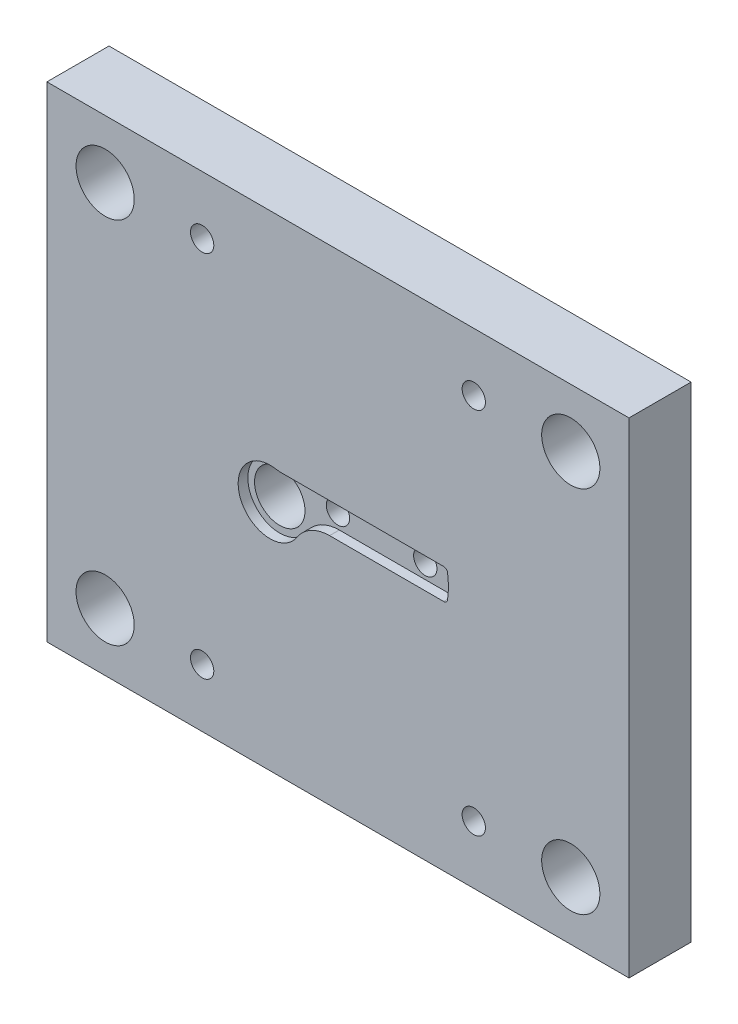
ISO-10303-21;
HEADER;
FILE_DESCRIPTION(('STEP AP214'),'2;1');
FILE_NAME('part.step','',(''),(''),'','','');
FILE_SCHEMA(('AUTOMOTIVE_DESIGN { 1 0 10303 214 1 1 1 1 }'));
ENDSEC;
DATA;
#1=APPLICATION_CONTEXT('core data for automotive mechanical design processes');
#2=APPLICATION_PROTOCOL_DEFINITION('international standard','automotive_design',2000,#1);
#3=PRODUCT_CONTEXT('',#1,'mechanical');
#4=PRODUCT('Part','Part','',(#3));
#5=PRODUCT_RELATED_PRODUCT_CATEGORY('part','',(#4));
#6=PRODUCT_DEFINITION_FORMATION('','',#4);
#7=PRODUCT_DEFINITION_CONTEXT('part definition',#1,'design');
#8=PRODUCT_DEFINITION('design','',#6,#7);
#9=PRODUCT_DEFINITION_SHAPE('','',#8);
#10=(LENGTH_UNIT() NAMED_UNIT(*) SI_UNIT(.MILLI.,.METRE.));
#11=(NAMED_UNIT(*) PLANE_ANGLE_UNIT() SI_UNIT($,.RADIAN.));
#12=(NAMED_UNIT(*) SI_UNIT($,.STERADIAN.) SOLID_ANGLE_UNIT());
#13=UNCERTAINTY_MEASURE_WITH_UNIT(LENGTH_MEASURE(1.E-05),#10,'distance_accuracy_value','');
#14=(GEOMETRIC_REPRESENTATION_CONTEXT(3) GLOBAL_UNCERTAINTY_ASSIGNED_CONTEXT((#13)) GLOBAL_UNIT_ASSIGNED_CONTEXT((#10,
#11,#12)) REPRESENTATION_CONTEXT('',''));
#15=CARTESIAN_POINT('',(0.,0.,0.));
#16=DIRECTION('',(0.,0.,1.));
#17=DIRECTION('',(1.,0.,0.));
#18=AXIS2_PLACEMENT_3D('',#15,#16,#17);
#19=CARTESIAN_POINT('',(0.,0.,32.));
#20=DIRECTION('',(1.,0.,0.));
#21=DIRECTION('',(0.,0.,-1.));
#22=AXIS2_PLACEMENT_3D('',#19,#20,#21);
#23=PLANE('',#22);
#24=DIRECTION('',(0.,-1.,0.));
#25=VECTOR('',#24,1.);
#26=CARTESIAN_POINT('',(0.,0.,0.));
#27=LINE('',#26,#25);
#28=CARTESIAN_POINT('',(0.,250.,0.));
#29=VERTEX_POINT('',#28);
#30=CARTESIAN_POINT('',(0.,0.,0.));
#31=VERTEX_POINT('',#30);
#32=EDGE_CURVE('E203',#29,#31,#27,.T.);
#33=ORIENTED_EDGE('',*,*,#32,.T.);
#34=DIRECTION('',(0.,0.,-1.));
#35=VECTOR('',#34,1.);
#36=CARTESIAN_POINT('',(0.,0.,32.));
#37=LINE('',#36,#35);
#38=CARTESIAN_POINT('',(0.,0.,32.));
#39=VERTEX_POINT('',#38);
#40=EDGE_CURVE('E11',#39,#31,#37,.T.);
#41=ORIENTED_EDGE('',*,*,#40,.F.);
#42=DIRECTION('',(0.,-1.,0.));
#43=VECTOR('',#42,1.);
#44=CARTESIAN_POINT('',(0.,0.,32.));
#45=LINE('',#44,#43);
#46=CARTESIAN_POINT('',(0.,250.,32.));
#47=VERTEX_POINT('',#46);
#48=EDGE_CURVE('E217',#47,#39,#45,.T.);
#49=ORIENTED_EDGE('',*,*,#48,.F.);
#50=DIRECTION('',(0.,0.,-1.));
#51=VECTOR('',#50,1.);
#52=CARTESIAN_POINT('',(0.,250.,32.));
#53=LINE('',#52,#51);
#54=EDGE_CURVE('E223',#47,#29,#53,.T.);
#55=ORIENTED_EDGE('',*,*,#54,.T.);
#56=EDGE_LOOP('',(#33,#41,#49,#55));
#57=FACE_BOUND('',#56,.T.);
#58=ADVANCED_FACE('F31',(#57),#23,.F.);
#59=CARTESIAN_POINT('',(0.,0.,32.));
#60=DIRECTION('',(0.,1.,0.));
#61=DIRECTION('',(0.,0.,1.));
#62=AXIS2_PLACEMENT_3D('',#59,#60,#61);
#63=PLANE('',#62);
#64=DIRECTION('',(1.,0.,0.));
#65=VECTOR('',#64,1.);
#66=CARTESIAN_POINT('',(0.,0.,0.));
#67=LINE('',#66,#65);
#68=CARTESIAN_POINT('',(300.,0.,0.));
#69=VERTEX_POINT('',#68);
#70=EDGE_CURVE('E226',#31,#69,#67,.T.);
#71=ORIENTED_EDGE('',*,*,#70,.T.);
#72=DIRECTION('',(0.,0.,-1.));
#73=VECTOR('',#72,1.);
#74=CARTESIAN_POINT('',(300.,0.,32.));
#75=LINE('',#74,#73);
#76=CARTESIAN_POINT('',(300.,0.,32.));
#77=VERTEX_POINT('',#76);
#78=EDGE_CURVE('E38',#77,#69,#75,.T.);
#79=ORIENTED_EDGE('',*,*,#78,.F.);
#80=DIRECTION('',(1.,0.,0.));
#81=VECTOR('',#80,1.);
#82=CARTESIAN_POINT('',(0.,0.,32.));
#83=LINE('',#82,#81);
#84=EDGE_CURVE('E82',#39,#77,#83,.T.);
#85=ORIENTED_EDGE('',*,*,#84,.F.);
#86=ORIENTED_EDGE('',*,*,#40,.T.);
#87=EDGE_LOOP('',(#71,#79,#85,#86));
#88=FACE_BOUND('',#87,.T.);
#89=ADVANCED_FACE('F255',(#88),#63,.F.);
#90=CARTESIAN_POINT('',(300.,0.,32.));
#91=DIRECTION('',(-1.,0.,0.));
#92=DIRECTION('',(0.,0.,1.));
#93=AXIS2_PLACEMENT_3D('',#90,#91,#92);
#94=PLANE('',#93);
#95=DIRECTION('',(0.,1.,0.));
#96=VECTOR('',#95,1.);
#97=CARTESIAN_POINT('',(300.,0.,0.));
#98=LINE('',#97,#96);
#99=CARTESIAN_POINT('',(300.,250.,0.));
#100=VERTEX_POINT('',#99);
#101=EDGE_CURVE('E228',#69,#100,#98,.T.);
#102=ORIENTED_EDGE('',*,*,#101,.T.);
#103=DIRECTION('',(0.,0.,-1.));
#104=VECTOR('',#103,1.);
#105=CARTESIAN_POINT('',(300.,250.,32.));
#106=LINE('',#105,#104);
#107=CARTESIAN_POINT('',(300.,250.,32.));
#108=VERTEX_POINT('',#107);
#109=EDGE_CURVE('E232',#108,#100,#106,.T.);
#110=ORIENTED_EDGE('',*,*,#109,.F.);
#111=DIRECTION('',(0.,1.,0.));
#112=VECTOR('',#111,1.);
#113=CARTESIAN_POINT('',(300.,0.,32.));
#114=LINE('',#113,#112);
#115=EDGE_CURVE('E220',#77,#108,#114,.T.);
#116=ORIENTED_EDGE('',*,*,#115,.F.);
#117=ORIENTED_EDGE('',*,*,#78,.T.);
#118=EDGE_LOOP('',(#102,#110,#116,#117));
#119=FACE_BOUND('',#118,.T.);
#120=ADVANCED_FACE('F237',(#119),#94,.F.);
#121=CARTESIAN_POINT('',(0.,250.,32.));
#122=DIRECTION('',(0.,-1.,0.));
#123=DIRECTION('',(0.,0.,-1.));
#124=AXIS2_PLACEMENT_3D('',#121,#122,#123);
#125=PLANE('',#124);
#126=DIRECTION('',(-1.,0.,0.));
#127=VECTOR('',#126,1.);
#128=CARTESIAN_POINT('',(0.,250.,0.));
#129=LINE('',#128,#127);
#130=EDGE_CURVE('E75',#100,#29,#129,.T.);
#131=ORIENTED_EDGE('',*,*,#130,.T.);
#132=ORIENTED_EDGE('',*,*,#54,.F.);
#133=DIRECTION('',(-1.,0.,0.));
#134=VECTOR('',#133,1.);
#135=CARTESIAN_POINT('',(0.,250.,32.));
#136=LINE('',#135,#134);
#137=EDGE_CURVE('E54',#108,#47,#136,.T.);
#138=ORIENTED_EDGE('',*,*,#137,.F.);
#139=ORIENTED_EDGE('',*,*,#109,.T.);
#140=EDGE_LOOP('',(#131,#132,#138,#139));
#141=FACE_BOUND('',#140,.T.);
#142=ADVANCED_FACE('F245',(#141),#125,.F.);
#143=CARTESIAN_POINT('',(0.,250.,32.));
#144=DIRECTION('',(0.,0.,-1.));
#145=DIRECTION('',(-1.,0.,0.));
#146=AXIS2_PLACEMENT_3D('',#143,#144,#145);
#147=PLANE('',#146);
#148=CARTESIAN_POINT('',(220.,30.,32.));
#149=DIRECTION('',(0.,0.,-1.));
#150=DIRECTION('',(-1.,0.,0.));
#151=AXIS2_PLACEMENT_3D('',#148,#149,#150);
#152=CIRCLE('',#151,6.00000000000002);
#153=CARTESIAN_POINT('',(214.,30.,32.));
#154=VERTEX_POINT('',#153);
#155=EDGE_CURVE('E698',#154,#154,#152,.T.);
#156=ORIENTED_EDGE('',*,*,#155,.T.);
#157=EDGE_LOOP('',(#156));
#158=FACE_BOUND('',#157,.T.);
#159=CARTESIAN_POINT('',(80.,30.,32.));
#160=DIRECTION('',(0.,0.,-1.));
#161=DIRECTION('',(-1.,0.,0.));
#162=AXIS2_PLACEMENT_3D('',#159,#160,#161);
#163=CIRCLE('',#162,6.);
#164=CARTESIAN_POINT('',(74.,30.,32.));
#165=VERTEX_POINT('',#164);
#166=EDGE_CURVE('E706',#165,#165,#163,.T.);
#167=ORIENTED_EDGE('',*,*,#166,.T.);
#168=EDGE_LOOP('',(#167));
#169=FACE_BOUND('',#168,.T.);
#170=CARTESIAN_POINT('',(80.,220.,32.));
#171=DIRECTION('',(0.,0.,-1.));
#172=DIRECTION('',(-1.,0.,0.));
#173=AXIS2_PLACEMENT_3D('',#170,#171,#172);
#174=CIRCLE('',#173,6.);
#175=CARTESIAN_POINT('',(74.,220.,32.));
#176=VERTEX_POINT('',#175);
#177=EDGE_CURVE('E712',#176,#176,#174,.T.);
#178=ORIENTED_EDGE('',*,*,#177,.T.);
#179=EDGE_LOOP('',(#178));
#180=FACE_BOUND('',#179,.T.);
#181=CARTESIAN_POINT('',(220.,220.,32.));
#182=DIRECTION('',(0.,0.,-1.));
#183=DIRECTION('',(-1.,0.,0.));
#184=AXIS2_PLACEMENT_3D('',#181,#182,#183);
#185=CIRCLE('',#184,6.00000000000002);
#186=CARTESIAN_POINT('',(214.,220.,32.));
#187=VERTEX_POINT('',#186);
#188=EDGE_CURVE('E718',#187,#187,#185,.T.);
#189=ORIENTED_EDGE('',*,*,#188,.T.);
#190=EDGE_LOOP('',(#189));
#191=FACE_BOUND('',#190,.T.);
#192=CARTESIAN_POINT('',(270.,220.,32.));
#193=DIRECTION('',(0.,0.,1.));
#194=DIRECTION('',(1.,0.,0.));
#195=AXIS2_PLACEMENT_3D('',#192,#193,#194);
#196=CIRCLE('',#195,15.);
#197=CARTESIAN_POINT('',(285.,220.,32.));
#198=VERTEX_POINT('',#197);
#199=EDGE_CURVE('E783',#198,#198,#196,.T.);
#200=ORIENTED_EDGE('',*,*,#199,.F.);
#201=EDGE_LOOP('',(#200));
#202=FACE_BOUND('',#201,.T.);
#203=CARTESIAN_POINT('',(270.,30.,32.));
#204=DIRECTION('',(0.,0.,1.));
#205=DIRECTION('',(1.,0.,0.));
#206=AXIS2_PLACEMENT_3D('',#203,#204,#205);
#207=CIRCLE('',#206,15.);
#208=CARTESIAN_POINT('',(285.,30.,32.));
#209=VERTEX_POINT('',#208);
#210=EDGE_CURVE('E786',#209,#209,#207,.T.);
#211=ORIENTED_EDGE('',*,*,#210,.F.);
#212=EDGE_LOOP('',(#211));
#213=FACE_BOUND('',#212,.T.);
#214=CARTESIAN_POINT('',(30.,30.,32.));
#215=DIRECTION('',(0.,0.,1.));
#216=DIRECTION('',(1.,0.,0.));
#217=AXIS2_PLACEMENT_3D('',#214,#215,#216);
#218=CIRCLE('',#217,15.);
#219=CARTESIAN_POINT('',(45.,30.,32.));
#220=VERTEX_POINT('',#219);
#221=EDGE_CURVE('E789',#220,#220,#218,.T.);
#222=ORIENTED_EDGE('',*,*,#221,.F.);
#223=EDGE_LOOP('',(#222));
#224=FACE_BOUND('',#223,.T.);
#225=CARTESIAN_POINT('',(30.,220.,32.));
#226=DIRECTION('',(0.,0.,1.));
#227=DIRECTION('',(1.,0.,0.));
#228=AXIS2_PLACEMENT_3D('',#225,#226,#227);
#229=CIRCLE('',#228,15.);
#230=CARTESIAN_POINT('',(45.,220.,32.));
#231=VERTEX_POINT('',#230);
#232=EDGE_CURVE('E792',#231,#231,#229,.T.);
#233=ORIENTED_EDGE('',*,*,#232,.F.);
#234=EDGE_LOOP('',(#233));
#235=FACE_BOUND('',#234,.T.);
#236=CARTESIAN_POINT('',(115.,120.,32.));
#237=DIRECTION('',(0.,0.,1.));
#238=DIRECTION('',(1.,0.,0.));
#239=AXIS2_PLACEMENT_3D('',#236,#237,#238);
#240=CIRCLE('',#239,16.445);
#241=CARTESIAN_POINT('',(117.740393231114,136.215063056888,32.));
#242=VERTEX_POINT('',#241);
#243=CARTESIAN_POINT('',(128.832928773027,111.106850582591,32.));
#244=VERTEX_POINT('',#243);
#245=EDGE_CURVE('E181',#242,#244,#240,.T.);
#246=ORIENTED_EDGE('',*,*,#245,.F.);
#247=CARTESIAN_POINT('',(121.078190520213,155.965,32.));
#248=DIRECTION('',(0.,0.,-1.));
#249=DIRECTION('',(-1.,0.,0.));
#250=AXIS2_PLACEMENT_3D('',#247,#248,#249);
#251=CIRCLE('',#250,20.03);
#252=CARTESIAN_POINT('',(121.078190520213,135.935,32.));
#253=VERTEX_POINT('',#252);
#254=EDGE_CURVE('E45',#253,#242,#251,.T.);
#255=ORIENTED_EDGE('',*,*,#254,.F.);
#256=DIRECTION('',(-1.,0.,0.));
#257=VECTOR('',#256,1.);
#258=CARTESIAN_POINT('',(121.078190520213,135.935,32.));
#259=LINE('',#258,#257);
#260=CARTESIAN_POINT('',(204.489847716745,135.935,32.));
#261=VERTEX_POINT('',#260);
#262=EDGE_CURVE('E155',#261,#253,#259,.T.);
#263=ORIENTED_EDGE('',*,*,#262,.F.);
#264=CARTESIAN_POINT('',(204.489847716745,133.905,32.));
#265=DIRECTION('',(0.,0.,1.));
#266=DIRECTION('',(-1.,0.,0.));
#267=AXIS2_PLACEMENT_3D('',#264,#265,#266);
#268=CIRCLE('',#267,2.03000000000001);
#269=CARTESIAN_POINT('',(206.512122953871,134.081926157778,32.));
#270=VERTEX_POINT('',#269);
#271=EDGE_CURVE('E158',#270,#261,#268,.T.);
#272=ORIENTED_EDGE('',*,*,#271,.F.);
#273=DIRECTION('',(-0.0871557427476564,0.996194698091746,0.));
#274=VECTOR('',#273,1.);
#275=CARTESIAN_POINT('',(206.512122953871,134.081926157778,32.));
#276=LINE('',#275,#274);
#277=CARTESIAN_POINT('',(207.033723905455,128.12,32.));
#278=VERTEX_POINT('',#277);
#279=EDGE_CURVE('E196',#278,#270,#276,.T.);
#280=ORIENTED_EDGE('',*,*,#279,.F.);
#281=DIRECTION('',(0.0871557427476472,0.996194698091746,0.));
#282=VECTOR('',#281,1.);
#283=CARTESIAN_POINT('',(206.512122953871,122.158073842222,32.));
#284=LINE('',#283,#282);
#285=CARTESIAN_POINT('',(206.512122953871,122.158073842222,32.));
#286=VERTEX_POINT('',#285);
#287=EDGE_CURVE('E193',#286,#278,#284,.T.);
#288=ORIENTED_EDGE('',*,*,#287,.F.);
#289=CARTESIAN_POINT('',(204.489847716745,122.335,32.));
#290=DIRECTION('',(0.,0.,1.));
#291=DIRECTION('',(1.,0.,0.));
#292=AXIS2_PLACEMENT_3D('',#289,#290,#291);
#293=CIRCLE('',#292,2.03000000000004);
#294=CARTESIAN_POINT('',(204.489847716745,120.305,32.));
#295=VERTEX_POINT('',#294);
#296=EDGE_CURVE('E190',#295,#286,#293,.T.);
#297=ORIENTED_EDGE('',*,*,#296,.F.);
#298=DIRECTION('',(1.,0.,0.));
#299=VECTOR('',#298,1.);
#300=CARTESIAN_POINT('',(145.681427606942,120.305,32.));
#301=LINE('',#300,#299);
#302=CARTESIAN_POINT('',(145.681427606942,120.305,32.));
#303=VERTEX_POINT('',#302);
#304=EDGE_CURVE('E187',#303,#295,#301,.T.);
#305=ORIENTED_EDGE('',*,*,#304,.F.);
#306=CARTESIAN_POINT('',(145.681427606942,100.275,32.));
#307=DIRECTION('',(0.,0.,-1.));
#308=DIRECTION('',(1.,0.,0.));
#309=AXIS2_PLACEMENT_3D('',#306,#307,#308);
#310=CIRCLE('',#309,20.03);
#311=EDGE_CURVE('E184',#244,#303,#310,.T.);
#312=ORIENTED_EDGE('',*,*,#311,.F.);
#313=EDGE_LOOP('',(#246,#255,#263,#272,#280,#288,#297,#305,#312));
#314=FACE_BOUND('',#313,.T.);
#315=ORIENTED_EDGE('',*,*,#48,.T.);
#316=ORIENTED_EDGE('',*,*,#84,.T.);
#317=ORIENTED_EDGE('',*,*,#115,.T.);
#318=ORIENTED_EDGE('',*,*,#137,.T.);
#319=EDGE_LOOP('',(#315,#316,#317,#318));
#320=FACE_BOUND('',#319,.T.);
#321=ADVANCED_FACE('F247',(#158,#169,#180,#191,#202,#213,#224,#235,#314,#320),#147,.F.);
#322=CARTESIAN_POINT('',(0.,250.,0.));
#323=DIRECTION('',(0.,0.,-1.));
#324=DIRECTION('',(-1.,0.,0.));
#325=AXIS2_PLACEMENT_3D('',#322,#323,#324);
#326=PLANE('',#325);
#327=CARTESIAN_POINT('',(220.,30.,0.));
#328=DIRECTION('',(0.,0.,-1.));
#329=DIRECTION('',(-1.,0.,0.));
#330=AXIS2_PLACEMENT_3D('',#327,#328,#329);
#331=CIRCLE('',#330,10.);
#332=CARTESIAN_POINT('',(210.,30.,0.));
#333=VERTEX_POINT('',#332);
#334=EDGE_CURVE('E721',#333,#333,#331,.T.);
#335=ORIENTED_EDGE('',*,*,#334,.F.);
#336=EDGE_LOOP('',(#335));
#337=FACE_BOUND('',#336,.T.);
#338=CARTESIAN_POINT('',(80.,30.,0.));
#339=DIRECTION('',(0.,0.,-1.));
#340=DIRECTION('',(-1.,0.,0.));
#341=AXIS2_PLACEMENT_3D('',#338,#339,#340);
#342=CIRCLE('',#341,9.99999999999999);
#343=CARTESIAN_POINT('',(70.,30.,0.));
#344=VERTEX_POINT('',#343);
#345=EDGE_CURVE('E727',#344,#344,#342,.T.);
#346=ORIENTED_EDGE('',*,*,#345,.F.);
#347=EDGE_LOOP('',(#346));
#348=FACE_BOUND('',#347,.T.);
#349=CARTESIAN_POINT('',(80.,220.,0.));
#350=DIRECTION('',(0.,0.,-1.));
#351=DIRECTION('',(-1.,0.,0.));
#352=AXIS2_PLACEMENT_3D('',#349,#350,#351);
#353=CIRCLE('',#352,10.);
#354=CARTESIAN_POINT('',(70.,220.,0.));
#355=VERTEX_POINT('',#354);
#356=EDGE_CURVE('E733',#355,#355,#353,.T.);
#357=ORIENTED_EDGE('',*,*,#356,.F.);
#358=EDGE_LOOP('',(#357));
#359=FACE_BOUND('',#358,.T.);
#360=CARTESIAN_POINT('',(220.,220.,0.));
#361=DIRECTION('',(0.,0.,-1.));
#362=DIRECTION('',(-1.,0.,0.));
#363=AXIS2_PLACEMENT_3D('',#360,#361,#362);
#364=CIRCLE('',#363,10.);
#365=CARTESIAN_POINT('',(210.,220.,0.));
#366=VERTEX_POINT('',#365);
#367=EDGE_CURVE('E739',#366,#366,#364,.T.);
#368=ORIENTED_EDGE('',*,*,#367,.F.);
#369=EDGE_LOOP('',(#368));
#370=FACE_BOUND('',#369,.T.);
#371=CARTESIAN_POINT('',(30.,30.,0.));
#372=DIRECTION('',(0.,0.,1.));
#373=DIRECTION('',(1.,0.,0.));
#374=AXIS2_PLACEMENT_3D('',#371,#372,#373);
#375=CIRCLE('',#374,23.);
#376=CARTESIAN_POINT('',(53.,30.,0.));
#377=VERTEX_POINT('',#376);
#378=EDGE_CURVE('E748',#377,#377,#375,.T.);
#379=ORIENTED_EDGE('',*,*,#378,.T.);
#380=EDGE_LOOP('',(#379));
#381=FACE_BOUND('',#380,.T.);
#382=CARTESIAN_POINT('',(270.,30.,0.));
#383=DIRECTION('',(0.,0.,1.));
#384=DIRECTION('',(1.,0.,0.));
#385=AXIS2_PLACEMENT_3D('',#382,#383,#384);
#386=CIRCLE('',#385,23.);
#387=CARTESIAN_POINT('',(293.,30.,0.));
#388=VERTEX_POINT('',#387);
#389=EDGE_CURVE('E757',#388,#388,#386,.T.);
#390=ORIENTED_EDGE('',*,*,#389,.T.);
#391=EDGE_LOOP('',(#390));
#392=FACE_BOUND('',#391,.T.);
#393=CARTESIAN_POINT('',(270.,220.,0.));
#394=DIRECTION('',(0.,0.,1.));
#395=DIRECTION('',(1.,0.,0.));
#396=AXIS2_PLACEMENT_3D('',#393,#394,#395);
#397=CIRCLE('',#396,23.);
#398=CARTESIAN_POINT('',(293.,220.,0.));
#399=VERTEX_POINT('',#398);
#400=EDGE_CURVE('E766',#399,#399,#397,.T.);
#401=ORIENTED_EDGE('',*,*,#400,.T.);
#402=EDGE_LOOP('',(#401));
#403=FACE_BOUND('',#402,.T.);
#404=CARTESIAN_POINT('',(30.,220.,0.));
#405=DIRECTION('',(0.,0.,1.));
#406=DIRECTION('',(1.,0.,0.));
#407=AXIS2_PLACEMENT_3D('',#404,#405,#406);
#408=CIRCLE('',#407,23.);
#409=CARTESIAN_POINT('',(53.,220.,0.));
#410=VERTEX_POINT('',#409);
#411=EDGE_CURVE('E775',#410,#410,#408,.T.);
#412=ORIENTED_EDGE('',*,*,#411,.T.);
#413=EDGE_LOOP('',(#412));
#414=FACE_BOUND('',#413,.T.);
#415=CARTESIAN_POINT('',(145.,128.12,0.));
#416=DIRECTION('',(0.,0.,1.));
#417=DIRECTION('',(1.,0.,0.));
#418=AXIS2_PLACEMENT_3D('',#415,#416,#417);
#419=CIRCLE('',#418,9.00000000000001);
#420=CARTESIAN_POINT('',(154.,128.12,0.));
#421=VERTEX_POINT('',#420);
#422=EDGE_CURVE('E796',#421,#421,#419,.T.);
#423=ORIENTED_EDGE('',*,*,#422,.T.);
#424=EDGE_LOOP('',(#423));
#425=FACE_BOUND('',#424,.T.);
#426=CARTESIAN_POINT('',(190.,128.12,0.));
#427=DIRECTION('',(0.,0.,1.));
#428=DIRECTION('',(1.,0.,0.));
#429=AXIS2_PLACEMENT_3D('',#426,#427,#428);
#430=CIRCLE('',#429,9.00000000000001);
#431=CARTESIAN_POINT('',(199.,128.12,0.));
#432=VERTEX_POINT('',#431);
#433=EDGE_CURVE('E805',#432,#432,#430,.T.);
#434=ORIENTED_EDGE('',*,*,#433,.T.);
#435=EDGE_LOOP('',(#434));
#436=FACE_BOUND('',#435,.T.);
#437=CARTESIAN_POINT('',(115.,120.,0.));
#438=DIRECTION('',(0.,0.,1.));
#439=DIRECTION('',(1.,0.,0.));
#440=AXIS2_PLACEMENT_3D('',#437,#438,#439);
#441=CIRCLE('',#440,13.);
#442=CARTESIAN_POINT('',(128.,120.,0.));
#443=VERTEX_POINT('',#442);
#444=EDGE_CURVE('E182',#443,#443,#441,.T.);
#445=ORIENTED_EDGE('',*,*,#444,.T.);
#446=EDGE_LOOP('',(#445));
#447=FACE_BOUND('',#446,.T.);
#448=ORIENTED_EDGE('',*,*,#32,.F.);
#449=ORIENTED_EDGE('',*,*,#130,.F.);
#450=ORIENTED_EDGE('',*,*,#101,.F.);
#451=ORIENTED_EDGE('',*,*,#70,.F.);
#452=EDGE_LOOP('',(#448,#449,#450,#451));
#453=FACE_BOUND('',#452,.T.);
#454=ADVANCED_FACE('F241',(#337,#348,#359,#370,#381,#392,#403,#414,#425,#436,#447,#453),#326,.T.);
#455=CARTESIAN_POINT('',(121.078190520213,155.965,27.));
#456=DIRECTION('',(0.,0.,1.));
#457=DIRECTION('',(1.,0.,0.));
#458=AXIS2_PLACEMENT_3D('',#455,#456,#457);
#459=CYLINDRICAL_SURFACE('',#458,20.03);
#460=ORIENTED_EDGE('',*,*,#254,.T.);
#461=DIRECTION('',(0.,0.,1.));
#462=VECTOR('',#461,1.);
#463=CARTESIAN_POINT('',(117.740393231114,136.215063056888,27.));
#464=LINE('',#463,#462);
#465=CARTESIAN_POINT('',(117.740393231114,136.215063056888,27.));
#466=VERTEX_POINT('',#465);
#467=EDGE_CURVE('E132',#466,#242,#464,.T.);
#468=ORIENTED_EDGE('',*,*,#467,.F.);
#469=CARTESIAN_POINT('',(121.078190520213,155.965,27.));
#470=DIRECTION('',(0.,0.,-1.));
#471=DIRECTION('',(-1.,0.,0.));
#472=AXIS2_PLACEMENT_3D('',#469,#470,#471);
#473=CIRCLE('',#472,20.03);
#474=CARTESIAN_POINT('',(121.078190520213,135.935,27.));
#475=VERTEX_POINT('',#474);
#476=EDGE_CURVE('E136',#475,#466,#473,.T.);
#477=ORIENTED_EDGE('',*,*,#476,.F.);
#478=DIRECTION('',(0.,0.,1.));
#479=VECTOR('',#478,1.);
#480=CARTESIAN_POINT('',(121.078190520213,135.935,27.));
#481=LINE('',#480,#479);
#482=EDGE_CURVE('E201',#475,#253,#481,.T.);
#483=ORIENTED_EDGE('',*,*,#482,.T.);
#484=EDGE_LOOP('',(#460,#468,#477,#483));
#485=FACE_BOUND('',#484,.T.);
#486=ADVANCED_FACE('F134',(#485),#459,.T.);
#487=CARTESIAN_POINT('',(121.078190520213,135.935,27.));
#488=DIRECTION('',(0.,1.,0.));
#489=DIRECTION('',(-1.,0.,0.));
#490=AXIS2_PLACEMENT_3D('',#487,#488,#489);
#491=PLANE('',#490);
#492=ORIENTED_EDGE('',*,*,#262,.T.);
#493=ORIENTED_EDGE('',*,*,#482,.F.);
#494=DIRECTION('',(-1.,0.,0.));
#495=VECTOR('',#494,1.);
#496=CARTESIAN_POINT('',(121.078190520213,135.935,27.));
#497=LINE('',#496,#495);
#498=CARTESIAN_POINT('',(204.489847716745,135.935,27.));
#499=VERTEX_POINT('',#498);
#500=EDGE_CURVE('E142',#499,#475,#497,.T.);
#501=ORIENTED_EDGE('',*,*,#500,.F.);
#502=DIRECTION('',(0.,0.,1.));
#503=VECTOR('',#502,1.);
#504=CARTESIAN_POINT('',(204.489847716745,135.935,27.));
#505=LINE('',#504,#503);
#506=EDGE_CURVE('E204',#499,#261,#505,.T.);
#507=ORIENTED_EDGE('',*,*,#506,.T.);
#508=EDGE_LOOP('',(#492,#493,#501,#507));
#509=FACE_BOUND('',#508,.T.);
#510=ADVANCED_FACE('F282',(#509),#491,.F.);
#511=CARTESIAN_POINT('',(204.489847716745,133.905,27.));
#512=DIRECTION('',(0.,0.,1.));
#513=DIRECTION('',(1.,0.,0.));
#514=AXIS2_PLACEMENT_3D('',#511,#512,#513);
#515=CYLINDRICAL_SURFACE('',#514,2.03000000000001);
#516=ORIENTED_EDGE('',*,*,#271,.T.);
#517=ORIENTED_EDGE('',*,*,#506,.F.);
#518=CARTESIAN_POINT('',(204.489847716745,133.905,27.));
#519=DIRECTION('',(0.,0.,1.));
#520=DIRECTION('',(-1.,0.,0.));
#521=AXIS2_PLACEMENT_3D('',#518,#519,#520);
#522=CIRCLE('',#521,2.03000000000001);
#523=CARTESIAN_POINT('',(206.512122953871,134.081926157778,27.));
#524=VERTEX_POINT('',#523);
#525=EDGE_CURVE('E177',#524,#499,#522,.T.);
#526=ORIENTED_EDGE('',*,*,#525,.F.);
#527=DIRECTION('',(0.,0.,1.));
#528=VECTOR('',#527,1.);
#529=CARTESIAN_POINT('',(206.512122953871,134.081926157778,27.));
#530=LINE('',#529,#528);
#531=EDGE_CURVE('E206',#524,#270,#530,.T.);
#532=ORIENTED_EDGE('',*,*,#531,.T.);
#533=EDGE_LOOP('',(#516,#517,#526,#532));
#534=FACE_BOUND('',#533,.T.);
#535=ADVANCED_FACE('F293',(#534),#515,.F.);
#536=CARTESIAN_POINT('',(206.512122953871,134.081926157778,27.));
#537=DIRECTION('',(0.996194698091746,0.0871557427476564,0.));
#538=DIRECTION('',(-0.0871557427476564,0.996194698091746,0.));
#539=AXIS2_PLACEMENT_3D('',#536,#537,#538);
#540=PLANE('',#539);
#541=ORIENTED_EDGE('',*,*,#279,.T.);
#542=ORIENTED_EDGE('',*,*,#531,.F.);
#543=DIRECTION('',(-0.0871557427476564,0.996194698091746,0.));
#544=VECTOR('',#543,1.);
#545=CARTESIAN_POINT('',(206.512122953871,134.081926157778,27.));
#546=LINE('',#545,#544);
#547=CARTESIAN_POINT('',(207.033723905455,128.12,27.));
#548=VERTEX_POINT('',#547);
#549=EDGE_CURVE('E174',#548,#524,#546,.T.);
#550=ORIENTED_EDGE('',*,*,#549,.F.);
#551=DIRECTION('',(0.,0.,1.));
#552=VECTOR('',#551,1.);
#553=CARTESIAN_POINT('',(207.033723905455,128.12,27.));
#554=LINE('',#553,#552);
#555=EDGE_CURVE('E208',#548,#278,#554,.T.);
#556=ORIENTED_EDGE('',*,*,#555,.T.);
#557=EDGE_LOOP('',(#541,#542,#550,#556));
#558=FACE_BOUND('',#557,.T.);
#559=ADVANCED_FACE('F303',(#558),#540,.F.);
#560=CARTESIAN_POINT('',(206.512122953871,122.158073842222,27.));
#561=DIRECTION('',(0.996194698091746,-0.0871557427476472,0.));
#562=DIRECTION('',(0.0871557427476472,0.996194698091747,0.));
#563=AXIS2_PLACEMENT_3D('',#560,#561,#562);
#564=PLANE('',#563);
#565=ORIENTED_EDGE('',*,*,#287,.T.);
#566=ORIENTED_EDGE('',*,*,#555,.F.);
#567=DIRECTION('',(0.0871557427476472,0.996194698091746,0.));
#568=VECTOR('',#567,1.);
#569=CARTESIAN_POINT('',(206.512122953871,122.158073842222,27.));
#570=LINE('',#569,#568);
#571=CARTESIAN_POINT('',(206.512122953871,122.158073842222,27.));
#572=VERTEX_POINT('',#571);
#573=EDGE_CURVE('E171',#572,#548,#570,.T.);
#574=ORIENTED_EDGE('',*,*,#573,.F.);
#575=DIRECTION('',(0.,0.,1.));
#576=VECTOR('',#575,1.);
#577=CARTESIAN_POINT('',(206.512122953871,122.158073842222,27.));
#578=LINE('',#577,#576);
#579=EDGE_CURVE('E210',#572,#286,#578,.T.);
#580=ORIENTED_EDGE('',*,*,#579,.T.);
#581=EDGE_LOOP('',(#565,#566,#574,#580));
#582=FACE_BOUND('',#581,.T.);
#583=ADVANCED_FACE('F313',(#582),#564,.F.);
#584=CARTESIAN_POINT('',(204.489847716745,122.335,27.));
#585=DIRECTION('',(0.,0.,1.));
#586=DIRECTION('',(1.,0.,0.));
#587=AXIS2_PLACEMENT_3D('',#584,#585,#586);
#588=CYLINDRICAL_SURFACE('',#587,2.03000000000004);
#589=ORIENTED_EDGE('',*,*,#296,.T.);
#590=ORIENTED_EDGE('',*,*,#579,.F.);
#591=CARTESIAN_POINT('',(204.489847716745,122.335,27.));
#592=DIRECTION('',(0.,0.,1.));
#593=DIRECTION('',(1.,0.,0.));
#594=AXIS2_PLACEMENT_3D('',#591,#592,#593);
#595=CIRCLE('',#594,2.03000000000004);
#596=CARTESIAN_POINT('',(204.489847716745,120.305,27.));
#597=VERTEX_POINT('',#596);
#598=EDGE_CURVE('E168',#597,#572,#595,.T.);
#599=ORIENTED_EDGE('',*,*,#598,.F.);
#600=DIRECTION('',(0.,0.,1.));
#601=VECTOR('',#600,1.);
#602=CARTESIAN_POINT('',(204.489847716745,120.305,27.));
#603=LINE('',#602,#601);
#604=EDGE_CURVE('E212',#597,#295,#603,.T.);
#605=ORIENTED_EDGE('',*,*,#604,.T.);
#606=EDGE_LOOP('',(#589,#590,#599,#605));
#607=FACE_BOUND('',#606,.T.);
#608=ADVANCED_FACE('F323',(#607),#588,.F.);
#609=CARTESIAN_POINT('',(145.681427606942,120.305,27.));
#610=DIRECTION('',(0.,-1.,0.));
#611=DIRECTION('',(1.,0.,0.));
#612=AXIS2_PLACEMENT_3D('',#609,#610,#611);
#613=PLANE('',#612);
#614=ORIENTED_EDGE('',*,*,#304,.T.);
#615=ORIENTED_EDGE('',*,*,#604,.F.);
#616=DIRECTION('',(1.,0.,0.));
#617=VECTOR('',#616,1.);
#618=CARTESIAN_POINT('',(145.681427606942,120.305,27.));
#619=LINE('',#618,#617);
#620=CARTESIAN_POINT('',(145.681427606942,120.305,27.));
#621=VERTEX_POINT('',#620);
#622=EDGE_CURVE('E165',#621,#597,#619,.T.);
#623=ORIENTED_EDGE('',*,*,#622,.F.);
#624=DIRECTION('',(0.,0.,1.));
#625=VECTOR('',#624,1.);
#626=CARTESIAN_POINT('',(145.681427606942,120.305,27.));
#627=LINE('',#626,#625);
#628=EDGE_CURVE('E214',#621,#303,#627,.T.);
#629=ORIENTED_EDGE('',*,*,#628,.T.);
#630=EDGE_LOOP('',(#614,#615,#623,#629));
#631=FACE_BOUND('',#630,.T.);
#632=ADVANCED_FACE('F333',(#631),#613,.F.);
#633=CARTESIAN_POINT('',(145.681427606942,100.275,27.));
#634=DIRECTION('',(0.,0.,1.));
#635=DIRECTION('',(1.,0.,0.));
#636=AXIS2_PLACEMENT_3D('',#633,#634,#635);
#637=CYLINDRICAL_SURFACE('',#636,20.03);
#638=ORIENTED_EDGE('',*,*,#311,.T.);
#639=ORIENTED_EDGE('',*,*,#628,.F.);
#640=CARTESIAN_POINT('',(145.681427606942,100.275,27.));
#641=DIRECTION('',(0.,0.,-1.));
#642=DIRECTION('',(1.,0.,0.));
#643=AXIS2_PLACEMENT_3D('',#640,#641,#642);
#644=CIRCLE('',#643,20.03);
#645=CARTESIAN_POINT('',(128.832928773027,111.106850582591,27.));
#646=VERTEX_POINT('',#645);
#647=EDGE_CURVE('E150',#646,#621,#644,.T.);
#648=ORIENTED_EDGE('',*,*,#647,.F.);
#649=DIRECTION('',(0.,0.,1.));
#650=VECTOR('',#649,1.);
#651=CARTESIAN_POINT('',(128.832928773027,111.106850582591,27.));
#652=LINE('',#651,#650);
#653=EDGE_CURVE('E141',#646,#244,#652,.T.);
#654=ORIENTED_EDGE('',*,*,#653,.T.);
#655=EDGE_LOOP('',(#638,#639,#648,#654));
#656=FACE_BOUND('',#655,.T.);
#657=ADVANCED_FACE('F343',(#656),#637,.T.);
#658=CARTESIAN_POINT('',(115.,120.,27.));
#659=DIRECTION('',(0.,0.,1.));
#660=DIRECTION('',(1.,0.,0.));
#661=AXIS2_PLACEMENT_3D('',#658,#659,#660);
#662=CYLINDRICAL_SURFACE('',#661,16.445);
#663=ORIENTED_EDGE('',*,*,#245,.T.);
#664=ORIENTED_EDGE('',*,*,#653,.F.);
#665=CARTESIAN_POINT('',(115.,120.,27.));
#666=DIRECTION('',(0.,0.,1.));
#667=DIRECTION('',(1.,0.,0.));
#668=AXIS2_PLACEMENT_3D('',#665,#666,#667);
#669=CIRCLE('',#668,16.445);
#670=EDGE_CURVE('E145',#466,#646,#669,.T.);
#671=ORIENTED_EDGE('',*,*,#670,.F.);
#672=ORIENTED_EDGE('',*,*,#467,.T.);
#673=EDGE_LOOP('',(#663,#664,#671,#672));
#674=FACE_BOUND('',#673,.T.);
#675=ADVANCED_FACE('F146',(#674),#662,.F.);
#676=CARTESIAN_POINT('',(121.078190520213,155.965,27.));
#677=DIRECTION('',(0.,0.,-1.));
#678=DIRECTION('',(-1.,0.,0.));
#679=AXIS2_PLACEMENT_3D('',#676,#677,#678);
#680=PLANE('',#679);
#681=CARTESIAN_POINT('',(145.,128.12,27.));
#682=DIRECTION('',(0.,0.,1.));
#683=DIRECTION('',(1.,0.,0.));
#684=AXIS2_PLACEMENT_3D('',#681,#682,#683);
#685=CIRCLE('',#684,6.00000000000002);
#686=CARTESIAN_POINT('',(151.,128.12,27.));
#687=VERTEX_POINT('',#686);
#688=EDGE_CURVE('E813',#687,#687,#685,.T.);
#689=ORIENTED_EDGE('',*,*,#688,.F.);
#690=EDGE_LOOP('',(#689));
#691=FACE_BOUND('',#690,.T.);
#692=CARTESIAN_POINT('',(190.,128.12,27.));
#693=DIRECTION('',(0.,0.,1.));
#694=DIRECTION('',(1.,0.,0.));
#695=AXIS2_PLACEMENT_3D('',#692,#693,#694);
#696=CIRCLE('',#695,6.00000000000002);
#697=CARTESIAN_POINT('',(196.,128.12,27.));
#698=VERTEX_POINT('',#697);
#699=EDGE_CURVE('E816',#698,#698,#696,.T.);
#700=ORIENTED_EDGE('',*,*,#699,.F.);
#701=EDGE_LOOP('',(#700));
#702=FACE_BOUND('',#701,.T.);
#703=CARTESIAN_POINT('',(115.,120.,27.));
#704=DIRECTION('',(0.,0.,1.));
#705=DIRECTION('',(1.,0.,0.));
#706=AXIS2_PLACEMENT_3D('',#703,#704,#705);
#707=CIRCLE('',#706,13.);
#708=CARTESIAN_POINT('',(128.,120.,27.));
#709=VERTEX_POINT('',#708);
#710=EDGE_CURVE('E161',#709,#709,#707,.T.);
#711=ORIENTED_EDGE('',*,*,#710,.F.);
#712=EDGE_LOOP('',(#711));
#713=FACE_BOUND('',#712,.T.);
#714=ORIENTED_EDGE('',*,*,#476,.T.);
#715=ORIENTED_EDGE('',*,*,#670,.T.);
#716=ORIENTED_EDGE('',*,*,#647,.T.);
#717=ORIENTED_EDGE('',*,*,#622,.T.);
#718=ORIENTED_EDGE('',*,*,#598,.T.);
#719=ORIENTED_EDGE('',*,*,#573,.T.);
#720=ORIENTED_EDGE('',*,*,#549,.T.);
#721=ORIENTED_EDGE('',*,*,#525,.T.);
#722=ORIENTED_EDGE('',*,*,#500,.T.);
#723=EDGE_LOOP('',(#714,#715,#716,#717,#718,#719,#720,#721,#722));
#724=FACE_BOUND('',#723,.T.);
#725=ADVANCED_FACE('F152',(#691,#702,#713,#724),#680,.F.);
#726=CARTESIAN_POINT('',(115.,120.,0.));
#727=DIRECTION('',(0.,0.,1.));
#728=DIRECTION('',(1.,0.,0.));
#729=AXIS2_PLACEMENT_3D('',#726,#727,#728);
#730=CYLINDRICAL_SURFACE('',#729,13.);
#731=ORIENTED_EDGE('',*,*,#444,.F.);
#732=EDGE_LOOP('',(#731));
#733=FACE_BOUND('',#732,.T.);
#734=ORIENTED_EDGE('',*,*,#710,.T.);
#735=EDGE_LOOP('',(#734));
#736=FACE_BOUND('',#735,.T.);
#737=ADVANCED_FACE('F368',(#733,#736),#730,.F.);
#738=CARTESIAN_POINT('',(190.,128.12,14.));
#739=DIRECTION('',(0.,0.,1.));
#740=DIRECTION('',(1.,0.,0.));
#741=AXIS2_PLACEMENT_3D('',#738,#739,#740);
#742=CYLINDRICAL_SURFACE('',#741,6.00000000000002);
#743=CARTESIAN_POINT('',(190.,128.12,14.));
#744=DIRECTION('',(0.,0.,1.));
#745=DIRECTION('',(1.,0.,0.));
#746=AXIS2_PLACEMENT_3D('',#743,#744,#745);
#747=CIRCLE('',#746,6.00000000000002);
#748=CARTESIAN_POINT('',(196.,128.12,14.));
#749=VERTEX_POINT('',#748);
#750=EDGE_CURVE('E808',#749,#749,#747,.F.);
#751=CARTESIAN_POINT('',(196.,128.12,14.));
#752=CARTESIAN_POINT('',(196.,128.12,14.1354166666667));
#753=CARTESIAN_POINT('',(196.,128.12,14.2708333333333));
#754=CARTESIAN_POINT('',(196.,128.12,14.5416666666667));
#755=CARTESIAN_POINT('',(196.,128.12,14.6770833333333));
#756=CARTESIAN_POINT('',(196.,128.12,14.9479166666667));
#757=CARTESIAN_POINT('',(196.,128.12,15.0833333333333));
#758=CARTESIAN_POINT('',(196.,128.12,15.3541666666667));
#759=CARTESIAN_POINT('',(196.,128.12,15.4895833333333));
#760=CARTESIAN_POINT('',(196.,128.12,15.7604166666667));
#761=CARTESIAN_POINT('',(196.,128.12,15.8958333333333));
#762=CARTESIAN_POINT('',(196.,128.12,16.1666666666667));
#763=CARTESIAN_POINT('',(196.,128.12,16.3020833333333));
#764=CARTESIAN_POINT('',(196.,128.12,16.5729166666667));
#765=CARTESIAN_POINT('',(196.,128.12,16.7083333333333));
#766=CARTESIAN_POINT('',(196.,128.12,16.9791666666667));
#767=CARTESIAN_POINT('',(196.,128.12,17.1145833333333));
#768=CARTESIAN_POINT('',(196.,128.12,17.3854166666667));
#769=CARTESIAN_POINT('',(196.,128.12,17.5208333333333));
#770=CARTESIAN_POINT('',(196.,128.12,17.7916666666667));
#771=CARTESIAN_POINT('',(196.,128.12,17.9270833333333));
#772=CARTESIAN_POINT('',(196.,128.12,18.1979166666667));
#773=CARTESIAN_POINT('',(196.,128.12,18.3333333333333));
#774=CARTESIAN_POINT('',(196.,128.12,18.6041666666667));
#775=CARTESIAN_POINT('',(196.,128.12,18.7395833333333));
#776=CARTESIAN_POINT('',(196.,128.12,19.0104166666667));
#777=CARTESIAN_POINT('',(196.,128.12,19.1458333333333));
#778=CARTESIAN_POINT('',(196.,128.12,19.4166666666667));
#779=CARTESIAN_POINT('',(196.,128.12,19.5520833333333));
#780=CARTESIAN_POINT('',(196.,128.12,19.8229166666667));
#781=CARTESIAN_POINT('',(196.,128.12,19.9583333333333));
#782=CARTESIAN_POINT('',(196.,128.12,20.2291666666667));
#783=CARTESIAN_POINT('',(196.,128.12,20.3645833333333));
#784=CARTESIAN_POINT('',(196.,128.12,20.6354166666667));
#785=CARTESIAN_POINT('',(196.,128.12,20.7708333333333));
#786=CARTESIAN_POINT('',(196.,128.12,21.0416666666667));
#787=CARTESIAN_POINT('',(196.,128.12,21.1770833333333));
#788=CARTESIAN_POINT('',(196.,128.12,21.4479166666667));
#789=CARTESIAN_POINT('',(196.,128.12,21.5833333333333));
#790=CARTESIAN_POINT('',(196.,128.12,21.8541666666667));
#791=CARTESIAN_POINT('',(196.,128.12,21.9895833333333));
#792=CARTESIAN_POINT('',(196.,128.12,22.2604166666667));
#793=CARTESIAN_POINT('',(196.,128.12,22.3958333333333));
#794=CARTESIAN_POINT('',(196.,128.12,22.6666666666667));
#795=CARTESIAN_POINT('',(196.,128.12,22.8020833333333));
#796=CARTESIAN_POINT('',(196.,128.12,23.0729166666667));
#797=CARTESIAN_POINT('',(196.,128.12,23.2083333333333));
#798=CARTESIAN_POINT('',(196.,128.12,23.4791666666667));
#799=CARTESIAN_POINT('',(196.,128.12,23.6145833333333));
#800=CARTESIAN_POINT('',(196.,128.12,23.8854166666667));
#801=CARTESIAN_POINT('',(196.,128.12,24.0208333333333));
#802=CARTESIAN_POINT('',(196.,128.12,24.2916666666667));
#803=CARTESIAN_POINT('',(196.,128.12,24.4270833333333));
#804=CARTESIAN_POINT('',(196.,128.12,24.6979166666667));
#805=CARTESIAN_POINT('',(196.,128.12,24.8333333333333));
#806=CARTESIAN_POINT('',(196.,128.12,25.1041666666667));
#807=CARTESIAN_POINT('',(196.,128.12,25.2395833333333));
#808=CARTESIAN_POINT('',(196.,128.12,25.5104166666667));
#809=CARTESIAN_POINT('',(196.,128.12,25.6458333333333));
#810=CARTESIAN_POINT('',(196.,128.12,25.9166666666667));
#811=CARTESIAN_POINT('',(196.,128.12,26.0520833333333));
#812=CARTESIAN_POINT('',(196.,128.12,26.3229166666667));
#813=CARTESIAN_POINT('',(196.,128.12,26.4583333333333));
#814=CARTESIAN_POINT('',(196.,128.12,26.7291666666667));
#815=CARTESIAN_POINT('',(196.,128.12,26.8645833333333));
#816=CARTESIAN_POINT('',(196.,128.12,27.));
#817=B_SPLINE_CURVE_WITH_KNOTS('',3,(#751,#752,#753,#754,#755,#756,#757,#758,#759,#760,#761,
#762,#763,#764,#765,#766,#767,#768,#769,#770,#771,#772,#773,#774,#775,#776,#777,#778,#779,#780,
#781,#782,#783,#784,#785,#786,#787,#788,#789,#790,#791,#792,#793,#794,#795,#796,#797,#798,#799,
#800,#801,#802,#803,#804,#805,#806,#807,#808,#809,#810,#811,#812,#813,#814,#815,#816),
.UNSPECIFIED.,.F.,.F.,(4,2,2,2,2,2,2,2,2,2,2,2,2,2,2,2,2,2,2,2,2,2,2,2,2,2,2,2,2,2,2,2,4),(0.,
0.40625,0.812500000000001,1.21875,1.625,2.03125,2.4375,2.84375,3.25,3.65625,4.0625,4.46875,
4.875,5.28125,5.6875,6.09375,6.5,6.90625,7.3125,7.71875,8.125,8.53125,8.9375,9.34375,9.75,
10.15625,10.5625,10.96875,11.375,11.78125,12.1875,12.59375,13.),.UNSPECIFIED.);
#818=EDGE_CURVE('BSEAM373',#749,#698,#817,.T.);
#819=ORIENTED_EDGE('',*,*,#750,.T.);
#820=ORIENTED_EDGE('',*,*,#699,.T.);
#821=ORIENTED_EDGE('',*,*,#818,.T.);
#822=ORIENTED_EDGE('',*,*,#818,.F.);
#823=EDGE_LOOP('',(#819,#821,#820,#822));
#824=FACE_BOUND('',#823,.T.);
#825=ADVANCED_FACE('F373',(#824),#742,.F.);
#826=CARTESIAN_POINT('',(145.,128.12,14.));
#827=DIRECTION('',(0.,0.,1.));
#828=DIRECTION('',(1.,0.,0.));
#829=AXIS2_PLACEMENT_3D('',#826,#827,#828);
#830=CYLINDRICAL_SURFACE('',#829,6.00000000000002);
#831=CARTESIAN_POINT('',(145.,128.12,14.));
#832=DIRECTION('',(0.,0.,1.));
#833=DIRECTION('',(1.,0.,0.));
#834=AXIS2_PLACEMENT_3D('',#831,#832,#833);
#835=CIRCLE('',#834,6.00000000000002);
#836=CARTESIAN_POINT('',(151.,128.12,14.));
#837=VERTEX_POINT('',#836);
#838=EDGE_CURVE('E799',#837,#837,#835,.F.);
#839=CARTESIAN_POINT('',(151.,128.12,14.));
#840=CARTESIAN_POINT('',(151.,128.12,14.1354166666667));
#841=CARTESIAN_POINT('',(151.,128.12,14.2708333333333));
#842=CARTESIAN_POINT('',(151.,128.12,14.5416666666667));
#843=CARTESIAN_POINT('',(151.,128.12,14.6770833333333));
#844=CARTESIAN_POINT('',(151.,128.12,14.9479166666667));
#845=CARTESIAN_POINT('',(151.,128.12,15.0833333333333));
#846=CARTESIAN_POINT('',(151.,128.12,15.3541666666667));
#847=CARTESIAN_POINT('',(151.,128.12,15.4895833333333));
#848=CARTESIAN_POINT('',(151.,128.12,15.7604166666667));
#849=CARTESIAN_POINT('',(151.,128.12,15.8958333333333));
#850=CARTESIAN_POINT('',(151.,128.12,16.1666666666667));
#851=CARTESIAN_POINT('',(151.,128.12,16.3020833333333));
#852=CARTESIAN_POINT('',(151.,128.12,16.5729166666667));
#853=CARTESIAN_POINT('',(151.,128.12,16.7083333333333));
#854=CARTESIAN_POINT('',(151.,128.12,16.9791666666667));
#855=CARTESIAN_POINT('',(151.,128.12,17.1145833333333));
#856=CARTESIAN_POINT('',(151.,128.12,17.3854166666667));
#857=CARTESIAN_POINT('',(151.,128.12,17.5208333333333));
#858=CARTESIAN_POINT('',(151.,128.12,17.7916666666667));
#859=CARTESIAN_POINT('',(151.,128.12,17.9270833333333));
#860=CARTESIAN_POINT('',(151.,128.12,18.1979166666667));
#861=CARTESIAN_POINT('',(151.,128.12,18.3333333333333));
#862=CARTESIAN_POINT('',(151.,128.12,18.6041666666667));
#863=CARTESIAN_POINT('',(151.,128.12,18.7395833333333));
#864=CARTESIAN_POINT('',(151.,128.12,19.0104166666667));
#865=CARTESIAN_POINT('',(151.,128.12,19.1458333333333));
#866=CARTESIAN_POINT('',(151.,128.12,19.4166666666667));
#867=CARTESIAN_POINT('',(151.,128.12,19.5520833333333));
#868=CARTESIAN_POINT('',(151.,128.12,19.8229166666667));
#869=CARTESIAN_POINT('',(151.,128.12,19.9583333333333));
#870=CARTESIAN_POINT('',(151.,128.12,20.2291666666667));
#871=CARTESIAN_POINT('',(151.,128.12,20.3645833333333));
#872=CARTESIAN_POINT('',(151.,128.12,20.6354166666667));
#873=CARTESIAN_POINT('',(151.,128.12,20.7708333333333));
#874=CARTESIAN_POINT('',(151.,128.12,21.0416666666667));
#875=CARTESIAN_POINT('',(151.,128.12,21.1770833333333));
#876=CARTESIAN_POINT('',(151.,128.12,21.4479166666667));
#877=CARTESIAN_POINT('',(151.,128.12,21.5833333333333));
#878=CARTESIAN_POINT('',(151.,128.12,21.8541666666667));
#879=CARTESIAN_POINT('',(151.,128.12,21.9895833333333));
#880=CARTESIAN_POINT('',(151.,128.12,22.2604166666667));
#881=CARTESIAN_POINT('',(151.,128.12,22.3958333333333));
#882=CARTESIAN_POINT('',(151.,128.12,22.6666666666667));
#883=CARTESIAN_POINT('',(151.,128.12,22.8020833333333));
#884=CARTESIAN_POINT('',(151.,128.12,23.0729166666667));
#885=CARTESIAN_POINT('',(151.,128.12,23.2083333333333));
#886=CARTESIAN_POINT('',(151.,128.12,23.4791666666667));
#887=CARTESIAN_POINT('',(151.,128.12,23.6145833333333));
#888=CARTESIAN_POINT('',(151.,128.12,23.8854166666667));
#889=CARTESIAN_POINT('',(151.,128.12,24.0208333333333));
#890=CARTESIAN_POINT('',(151.,128.12,24.2916666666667));
#891=CARTESIAN_POINT('',(151.,128.12,24.4270833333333));
#892=CARTESIAN_POINT('',(151.,128.12,24.6979166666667));
#893=CARTESIAN_POINT('',(151.,128.12,24.8333333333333));
#894=CARTESIAN_POINT('',(151.,128.12,25.1041666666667));
#895=CARTESIAN_POINT('',(151.,128.12,25.2395833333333));
#896=CARTESIAN_POINT('',(151.,128.12,25.5104166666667));
#897=CARTESIAN_POINT('',(151.,128.12,25.6458333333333));
#898=CARTESIAN_POINT('',(151.,128.12,25.9166666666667));
#899=CARTESIAN_POINT('',(151.,128.12,26.0520833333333));
#900=CARTESIAN_POINT('',(151.,128.12,26.3229166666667));
#901=CARTESIAN_POINT('',(151.,128.12,26.4583333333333));
#902=CARTESIAN_POINT('',(151.,128.12,26.7291666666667));
#903=CARTESIAN_POINT('',(151.,128.12,26.8645833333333));
#904=CARTESIAN_POINT('',(151.,128.12,27.));
#905=B_SPLINE_CURVE_WITH_KNOTS('',3,(#839,#840,#841,#842,#843,#844,#845,#846,#847,#848,#849,
#850,#851,#852,#853,#854,#855,#856,#857,#858,#859,#860,#861,#862,#863,#864,#865,#866,#867,#868,
#869,#870,#871,#872,#873,#874,#875,#876,#877,#878,#879,#880,#881,#882,#883,#884,#885,#886,#887,
#888,#889,#890,#891,#892,#893,#894,#895,#896,#897,#898,#899,#900,#901,#902,#903,#904),
.UNSPECIFIED.,.F.,.F.,(4,2,2,2,2,2,2,2,2,2,2,2,2,2,2,2,2,2,2,2,2,2,2,2,2,2,2,2,2,2,2,2,4),(0.,
0.40625,0.812500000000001,1.21875,1.625,2.03125,2.4375,2.84375,3.25,3.65625,4.0625,4.46875,
4.875,5.28125,5.6875,6.09375,6.5,6.90625,7.3125,7.71875,8.125,8.53125,8.9375,9.34375,9.75,
10.15625,10.5625,10.96875,11.375,11.78125,12.1875,12.59375,13.),.UNSPECIFIED.);
#906=EDGE_CURVE('BSEAM390',#837,#687,#905,.T.);
#907=ORIENTED_EDGE('',*,*,#838,.T.);
#908=ORIENTED_EDGE('',*,*,#688,.T.);
#909=ORIENTED_EDGE('',*,*,#906,.T.);
#910=ORIENTED_EDGE('',*,*,#906,.F.);
#911=EDGE_LOOP('',(#907,#909,#908,#910));
#912=FACE_BOUND('',#911,.T.);
#913=ADVANCED_FACE('F390',(#912),#830,.F.);
#914=CARTESIAN_POINT('',(190.,128.12,14.));
#915=DIRECTION('',(0.,0.,1.));
#916=DIRECTION('',(1.,0.,0.));
#917=AXIS2_PLACEMENT_3D('',#914,#915,#916);
#918=PLANE('',#917);
#919=CARTESIAN_POINT('',(190.,128.12,14.));
#920=DIRECTION('',(0.,0.,1.));
#921=DIRECTION('',(1.,0.,0.));
#922=AXIS2_PLACEMENT_3D('',#919,#920,#921);
#923=CIRCLE('',#922,9.00000000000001);
#924=CARTESIAN_POINT('',(199.,128.12,14.));
#925=VERTEX_POINT('',#924);
#926=EDGE_CURVE('E804',#925,#925,#923,.T.);
#927=ORIENTED_EDGE('',*,*,#926,.F.);
#928=EDGE_LOOP('',(#927));
#929=FACE_BOUND('',#928,.T.);
#930=ORIENTED_EDGE('',*,*,#750,.F.);
#931=EDGE_LOOP('',(#930));
#932=FACE_BOUND('',#931,.T.);
#933=ADVANCED_FACE('F400',(#929,#932),#918,.F.);
#934=CARTESIAN_POINT('',(190.,128.12,0.));
#935=DIRECTION('',(0.,0.,1.));
#936=DIRECTION('',(1.,0.,0.));
#937=AXIS2_PLACEMENT_3D('',#934,#935,#936);
#938=CYLINDRICAL_SURFACE('',#937,9.00000000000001);
#939=ORIENTED_EDGE('',*,*,#433,.F.);
#940=EDGE_LOOP('',(#939));
#941=FACE_BOUND('',#940,.T.);
#942=ORIENTED_EDGE('',*,*,#926,.T.);
#943=EDGE_LOOP('',(#942));
#944=FACE_BOUND('',#943,.T.);
#945=ADVANCED_FACE('F410',(#941,#944),#938,.F.);
#946=CARTESIAN_POINT('',(145.,128.12,14.));
#947=DIRECTION('',(0.,0.,1.));
#948=DIRECTION('',(1.,0.,0.));
#949=AXIS2_PLACEMENT_3D('',#946,#947,#948);
#950=PLANE('',#949);
#951=CARTESIAN_POINT('',(145.,128.12,14.));
#952=DIRECTION('',(0.,0.,1.));
#953=DIRECTION('',(1.,0.,0.));
#954=AXIS2_PLACEMENT_3D('',#951,#952,#953);
#955=CIRCLE('',#954,9.00000000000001);
#956=CARTESIAN_POINT('',(154.,128.12,14.));
#957=VERTEX_POINT('',#956);
#958=EDGE_CURVE('E795',#957,#957,#955,.T.);
#959=ORIENTED_EDGE('',*,*,#958,.F.);
#960=EDGE_LOOP('',(#959));
#961=FACE_BOUND('',#960,.T.);
#962=ORIENTED_EDGE('',*,*,#838,.F.);
#963=EDGE_LOOP('',(#962));
#964=FACE_BOUND('',#963,.T.);
#965=ADVANCED_FACE('F420',(#961,#964),#950,.F.);
#966=CARTESIAN_POINT('',(145.,128.12,0.));
#967=DIRECTION('',(0.,0.,1.));
#968=DIRECTION('',(1.,0.,0.));
#969=AXIS2_PLACEMENT_3D('',#966,#967,#968);
#970=CYLINDRICAL_SURFACE('',#969,9.00000000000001);
#971=ORIENTED_EDGE('',*,*,#422,.F.);
#972=EDGE_LOOP('',(#971));
#973=FACE_BOUND('',#972,.T.);
#974=ORIENTED_EDGE('',*,*,#958,.T.);
#975=EDGE_LOOP('',(#974));
#976=FACE_BOUND('',#975,.T.);
#977=ADVANCED_FACE('F430',(#973,#976),#970,.F.);
#978=CARTESIAN_POINT('',(30.,220.,10.));
#979=DIRECTION('',(0.,0.,1.));
#980=DIRECTION('',(1.,0.,0.));
#981=AXIS2_PLACEMENT_3D('',#978,#979,#980);
#982=CYLINDRICAL_SURFACE('',#981,15.);
#983=CARTESIAN_POINT('',(30.,220.,10.));
#984=DIRECTION('',(0.,0.,1.));
#985=DIRECTION('',(1.,0.,0.));
#986=AXIS2_PLACEMENT_3D('',#983,#984,#985);
#987=CIRCLE('',#986,15.);
#988=CARTESIAN_POINT('',(45.,220.,10.));
#989=VERTEX_POINT('',#988);
#990=EDGE_CURVE('E778',#989,#989,#987,.F.);
#991=ORIENTED_EDGE('',*,*,#990,.T.);
#992=EDGE_LOOP('',(#991));
#993=FACE_BOUND('',#992,.T.);
#994=ORIENTED_EDGE('',*,*,#232,.T.);
#995=EDGE_LOOP('',(#994));
#996=FACE_BOUND('',#995,.T.);
#997=ADVANCED_FACE('F440',(#993,#996),#982,.F.);
#998=CARTESIAN_POINT('',(30.,30.,10.));
#999=DIRECTION('',(0.,0.,1.));
#1000=DIRECTION('',(1.,0.,0.));
#1001=AXIS2_PLACEMENT_3D('',#998,#999,#1000);
#1002=CYLINDRICAL_SURFACE('',#1001,15.);
#1003=CARTESIAN_POINT('',(30.,30.,10.));
#1004=DIRECTION('',(0.,0.,1.));
#1005=DIRECTION('',(1.,0.,0.));
#1006=AXIS2_PLACEMENT_3D('',#1003,#1004,#1005);
#1007=CIRCLE('',#1006,15.);
#1008=CARTESIAN_POINT('',(45.,30.,10.));
#1009=VERTEX_POINT('',#1008);
#1010=EDGE_CURVE('E751',#1009,#1009,#1007,.F.);
#1011=ORIENTED_EDGE('',*,*,#1010,.T.);
#1012=EDGE_LOOP('',(#1011));
#1013=FACE_BOUND('',#1012,.T.);
#1014=ORIENTED_EDGE('',*,*,#221,.T.);
#1015=EDGE_LOOP('',(#1014));
#1016=FACE_BOUND('',#1015,.T.);
#1017=ADVANCED_FACE('F450',(#1013,#1016),#1002,.F.);
#1018=CARTESIAN_POINT('',(270.,30.,10.));
#1019=DIRECTION('',(0.,0.,1.));
#1020=DIRECTION('',(1.,0.,0.));
#1021=AXIS2_PLACEMENT_3D('',#1018,#1019,#1020);
#1022=CYLINDRICAL_SURFACE('',#1021,15.);
#1023=CARTESIAN_POINT('',(270.,30.,10.));
#1024=DIRECTION('',(0.,0.,1.));
#1025=DIRECTION('',(1.,0.,0.));
#1026=AXIS2_PLACEMENT_3D('',#1023,#1024,#1025);
#1027=CIRCLE('',#1026,15.);
#1028=CARTESIAN_POINT('',(285.,30.,10.));
#1029=VERTEX_POINT('',#1028);
#1030=EDGE_CURVE('E760',#1029,#1029,#1027,.F.);
#1031=ORIENTED_EDGE('',*,*,#1030,.T.);
#1032=EDGE_LOOP('',(#1031));
#1033=FACE_BOUND('',#1032,.T.);
#1034=ORIENTED_EDGE('',*,*,#210,.T.);
#1035=EDGE_LOOP('',(#1034));
#1036=FACE_BOUND('',#1035,.T.);
#1037=ADVANCED_FACE('F460',(#1033,#1036),#1022,.F.);
#1038=CARTESIAN_POINT('',(270.,220.,10.));
#1039=DIRECTION('',(0.,0.,1.));
#1040=DIRECTION('',(1.,0.,0.));
#1041=AXIS2_PLACEMENT_3D('',#1038,#1039,#1040);
#1042=CYLINDRICAL_SURFACE('',#1041,15.);
#1043=CARTESIAN_POINT('',(270.,220.,10.));
#1044=DIRECTION('',(0.,0.,1.));
#1045=DIRECTION('',(1.,0.,0.));
#1046=AXIS2_PLACEMENT_3D('',#1043,#1044,#1045);
#1047=CIRCLE('',#1046,15.);
#1048=CARTESIAN_POINT('',(285.,220.,10.));
#1049=VERTEX_POINT('',#1048);
#1050=EDGE_CURVE('E769',#1049,#1049,#1047,.F.);
#1051=ORIENTED_EDGE('',*,*,#1050,.T.);
#1052=EDGE_LOOP('',(#1051));
#1053=FACE_BOUND('',#1052,.T.);
#1054=ORIENTED_EDGE('',*,*,#199,.T.);
#1055=EDGE_LOOP('',(#1054));
#1056=FACE_BOUND('',#1055,.T.);
#1057=ADVANCED_FACE('F470',(#1053,#1056),#1042,.F.);
#1058=CARTESIAN_POINT('',(30.,220.,10.));
#1059=DIRECTION('',(0.,0.,1.));
#1060=DIRECTION('',(1.,0.,0.));
#1061=AXIS2_PLACEMENT_3D('',#1058,#1059,#1060);
#1062=PLANE('',#1061);
#1063=CARTESIAN_POINT('',(30.,220.,10.));
#1064=DIRECTION('',(0.,0.,1.));
#1065=DIRECTION('',(1.,0.,0.));
#1066=AXIS2_PLACEMENT_3D('',#1063,#1064,#1065);
#1067=CIRCLE('',#1066,23.);
#1068=CARTESIAN_POINT('',(53.,220.,10.));
#1069=VERTEX_POINT('',#1068);
#1070=EDGE_CURVE('E774',#1069,#1069,#1067,.T.);
#1071=ORIENTED_EDGE('',*,*,#1070,.F.);
#1072=EDGE_LOOP('',(#1071));
#1073=FACE_BOUND('',#1072,.T.);
#1074=ORIENTED_EDGE('',*,*,#990,.F.);
#1075=EDGE_LOOP('',(#1074));
#1076=FACE_BOUND('',#1075,.T.);
#1077=ADVANCED_FACE('F480',(#1073,#1076),#1062,.F.);
#1078=CARTESIAN_POINT('',(30.,220.,0.));
#1079=DIRECTION('',(0.,0.,1.));
#1080=DIRECTION('',(1.,0.,0.));
#1081=AXIS2_PLACEMENT_3D('',#1078,#1079,#1080);
#1082=CYLINDRICAL_SURFACE('',#1081,23.);
#1083=ORIENTED_EDGE('',*,*,#411,.F.);
#1084=EDGE_LOOP('',(#1083));
#1085=FACE_BOUND('',#1084,.T.);
#1086=ORIENTED_EDGE('',*,*,#1070,.T.);
#1087=EDGE_LOOP('',(#1086));
#1088=FACE_BOUND('',#1087,.T.);
#1089=ADVANCED_FACE('F490',(#1085,#1088),#1082,.F.);
#1090=CARTESIAN_POINT('',(270.,220.,10.));
#1091=DIRECTION('',(0.,0.,1.));
#1092=DIRECTION('',(1.,0.,0.));
#1093=AXIS2_PLACEMENT_3D('',#1090,#1091,#1092);
#1094=PLANE('',#1093);
#1095=CARTESIAN_POINT('',(270.,220.,10.));
#1096=DIRECTION('',(0.,0.,1.));
#1097=DIRECTION('',(1.,0.,0.));
#1098=AXIS2_PLACEMENT_3D('',#1095,#1096,#1097);
#1099=CIRCLE('',#1098,23.);
#1100=CARTESIAN_POINT('',(293.,220.,10.));
#1101=VERTEX_POINT('',#1100);
#1102=EDGE_CURVE('E765',#1101,#1101,#1099,.T.);
#1103=ORIENTED_EDGE('',*,*,#1102,.F.);
#1104=EDGE_LOOP('',(#1103));
#1105=FACE_BOUND('',#1104,.T.);
#1106=ORIENTED_EDGE('',*,*,#1050,.F.);
#1107=EDGE_LOOP('',(#1106));
#1108=FACE_BOUND('',#1107,.T.);
#1109=ADVANCED_FACE('F500',(#1105,#1108),#1094,.F.);
#1110=CARTESIAN_POINT('',(270.,220.,0.));
#1111=DIRECTION('',(0.,0.,1.));
#1112=DIRECTION('',(1.,0.,0.));
#1113=AXIS2_PLACEMENT_3D('',#1110,#1111,#1112);
#1114=CYLINDRICAL_SURFACE('',#1113,23.);
#1115=ORIENTED_EDGE('',*,*,#400,.F.);
#1116=EDGE_LOOP('',(#1115));
#1117=FACE_BOUND('',#1116,.T.);
#1118=ORIENTED_EDGE('',*,*,#1102,.T.);
#1119=EDGE_LOOP('',(#1118));
#1120=FACE_BOUND('',#1119,.T.);
#1121=ADVANCED_FACE('F510',(#1117,#1120),#1114,.F.);
#1122=CARTESIAN_POINT('',(270.,30.,10.));
#1123=DIRECTION('',(0.,0.,1.));
#1124=DIRECTION('',(1.,0.,0.));
#1125=AXIS2_PLACEMENT_3D('',#1122,#1123,#1124);
#1126=PLANE('',#1125);
#1127=CARTESIAN_POINT('',(270.,30.,10.));
#1128=DIRECTION('',(0.,0.,1.));
#1129=DIRECTION('',(1.,0.,0.));
#1130=AXIS2_PLACEMENT_3D('',#1127,#1128,#1129);
#1131=CIRCLE('',#1130,23.);
#1132=CARTESIAN_POINT('',(293.,30.,10.));
#1133=VERTEX_POINT('',#1132);
#1134=EDGE_CURVE('E756',#1133,#1133,#1131,.T.);
#1135=ORIENTED_EDGE('',*,*,#1134,.F.);
#1136=EDGE_LOOP('',(#1135));
#1137=FACE_BOUND('',#1136,.T.);
#1138=ORIENTED_EDGE('',*,*,#1030,.F.);
#1139=EDGE_LOOP('',(#1138));
#1140=FACE_BOUND('',#1139,.T.);
#1141=ADVANCED_FACE('F520',(#1137,#1140),#1126,.F.);
#1142=CARTESIAN_POINT('',(270.,30.,0.));
#1143=DIRECTION('',(0.,0.,1.));
#1144=DIRECTION('',(1.,0.,0.));
#1145=AXIS2_PLACEMENT_3D('',#1142,#1143,#1144);
#1146=CYLINDRICAL_SURFACE('',#1145,23.);
#1147=ORIENTED_EDGE('',*,*,#389,.F.);
#1148=EDGE_LOOP('',(#1147));
#1149=FACE_BOUND('',#1148,.T.);
#1150=ORIENTED_EDGE('',*,*,#1134,.T.);
#1151=EDGE_LOOP('',(#1150));
#1152=FACE_BOUND('',#1151,.T.);
#1153=ADVANCED_FACE('F530',(#1149,#1152),#1146,.F.);
#1154=CARTESIAN_POINT('',(30.,30.,10.));
#1155=DIRECTION('',(0.,0.,1.));
#1156=DIRECTION('',(1.,0.,0.));
#1157=AXIS2_PLACEMENT_3D('',#1154,#1155,#1156);
#1158=PLANE('',#1157);
#1159=CARTESIAN_POINT('',(30.,30.,10.));
#1160=DIRECTION('',(0.,0.,1.));
#1161=DIRECTION('',(1.,0.,0.));
#1162=AXIS2_PLACEMENT_3D('',#1159,#1160,#1161);
#1163=CIRCLE('',#1162,23.);
#1164=CARTESIAN_POINT('',(53.,30.,10.));
#1165=VERTEX_POINT('',#1164);
#1166=EDGE_CURVE('E745',#1165,#1165,#1163,.T.);
#1167=ORIENTED_EDGE('',*,*,#1166,.F.);
#1168=EDGE_LOOP('',(#1167));
#1169=FACE_BOUND('',#1168,.T.);
#1170=ORIENTED_EDGE('',*,*,#1010,.F.);
#1171=EDGE_LOOP('',(#1170));
#1172=FACE_BOUND('',#1171,.T.);
#1173=ADVANCED_FACE('F540',(#1169,#1172),#1158,.F.);
#1174=CARTESIAN_POINT('',(30.,30.,0.));
#1175=DIRECTION('',(0.,0.,1.));
#1176=DIRECTION('',(1.,0.,0.));
#1177=AXIS2_PLACEMENT_3D('',#1174,#1175,#1176);
#1178=CYLINDRICAL_SURFACE('',#1177,23.);
#1179=ORIENTED_EDGE('',*,*,#378,.F.);
#1180=EDGE_LOOP('',(#1179));
#1181=FACE_BOUND('',#1180,.T.);
#1182=ORIENTED_EDGE('',*,*,#1166,.T.);
#1183=EDGE_LOOP('',(#1182));
#1184=FACE_BOUND('',#1183,.T.);
#1185=ADVANCED_FACE('F550',(#1181,#1184),#1178,.F.);
#1186=CARTESIAN_POINT('',(220.,220.,21.5));
#1187=DIRECTION('',(0.,0.,-1.));
#1188=DIRECTION('',(-1.,0.,0.));
#1189=AXIS2_PLACEMENT_3D('',#1186,#1187,#1188);
#1190=CYLINDRICAL_SURFACE('',#1189,10.);
#1191=CARTESIAN_POINT('',(220.,220.,21.5));
#1192=DIRECTION('',(0.,0.,-1.));
#1193=DIRECTION('',(-1.,0.,0.));
#1194=AXIS2_PLACEMENT_3D('',#1191,#1192,#1193);
#1195=CIRCLE('',#1194,10.);
#1196=CARTESIAN_POINT('',(210.,220.,21.5));
#1197=VERTEX_POINT('',#1196);
#1198=EDGE_CURVE('E742',#1197,#1197,#1195,.T.);
#1199=ORIENTED_EDGE('',*,*,#1198,.F.);
#1200=EDGE_LOOP('',(#1199));
#1201=FACE_BOUND('',#1200,.T.);
#1202=ORIENTED_EDGE('',*,*,#367,.T.);
#1203=EDGE_LOOP('',(#1202));
#1204=FACE_BOUND('',#1203,.T.);
#1205=ADVANCED_FACE('F560',(#1201,#1204),#1190,.F.);
#1206=CARTESIAN_POINT('',(220.,220.,21.5));
#1207=DIRECTION('',(0.,0.,-1.));
#1208=DIRECTION('',(-1.,0.,0.));
#1209=AXIS2_PLACEMENT_3D('',#1206,#1207,#1208);
#1210=PLANE('',#1209);
#1211=CARTESIAN_POINT('',(220.,220.,21.5));
#1212=DIRECTION('',(0.,0.,-1.));
#1213=DIRECTION('',(-1.,0.,0.));
#1214=AXIS2_PLACEMENT_3D('',#1211,#1212,#1213);
#1215=CIRCLE('',#1214,6.00000000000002);
#1216=CARTESIAN_POINT('',(214.,220.,21.5));
#1217=VERTEX_POINT('',#1216);
#1218=EDGE_CURVE('E715',#1217,#1217,#1215,.T.);
#1219=ORIENTED_EDGE('',*,*,#1218,.F.);
#1220=EDGE_LOOP('',(#1219));
#1221=FACE_BOUND('',#1220,.T.);
#1222=ORIENTED_EDGE('',*,*,#1198,.T.);
#1223=EDGE_LOOP('',(#1222));
#1224=FACE_BOUND('',#1223,.T.);
#1225=ADVANCED_FACE('F576',(#1221,#1224),#1210,.T.);
#1226=CARTESIAN_POINT('',(80.,220.,21.5));
#1227=DIRECTION('',(0.,0.,-1.));
#1228=DIRECTION('',(-1.,0.,0.));
#1229=AXIS2_PLACEMENT_3D('',#1226,#1227,#1228);
#1230=CYLINDRICAL_SURFACE('',#1229,10.);
#1231=CARTESIAN_POINT('',(80.,220.,21.5));
#1232=DIRECTION('',(0.,0.,-1.));
#1233=DIRECTION('',(-1.,0.,0.));
#1234=AXIS2_PLACEMENT_3D('',#1231,#1232,#1233);
#1235=CIRCLE('',#1234,10.);
#1236=CARTESIAN_POINT('',(70.,220.,21.5));
#1237=VERTEX_POINT('',#1236);
#1238=EDGE_CURVE('E736',#1237,#1237,#1235,.T.);
#1239=ORIENTED_EDGE('',*,*,#1238,.F.);
#1240=EDGE_LOOP('',(#1239));
#1241=FACE_BOUND('',#1240,.T.);
#1242=ORIENTED_EDGE('',*,*,#356,.T.);
#1243=EDGE_LOOP('',(#1242));
#1244=FACE_BOUND('',#1243,.T.);
#1245=ADVANCED_FACE('F584',(#1241,#1244),#1230,.F.);
#1246=CARTESIAN_POINT('',(80.,220.,21.5));
#1247=DIRECTION('',(0.,0.,-1.));
#1248=DIRECTION('',(-1.,0.,0.));
#1249=AXIS2_PLACEMENT_3D('',#1246,#1247,#1248);
#1250=PLANE('',#1249);
#1251=CARTESIAN_POINT('',(80.,220.,21.5));
#1252=DIRECTION('',(0.,0.,-1.));
#1253=DIRECTION('',(-1.,0.,0.));
#1254=AXIS2_PLACEMENT_3D('',#1251,#1252,#1253);
#1255=CIRCLE('',#1254,6.);
#1256=CARTESIAN_POINT('',(74.,220.,21.5));
#1257=VERTEX_POINT('',#1256);
#1258=EDGE_CURVE('E709',#1257,#1257,#1255,.T.);
#1259=ORIENTED_EDGE('',*,*,#1258,.F.);
#1260=EDGE_LOOP('',(#1259));
#1261=FACE_BOUND('',#1260,.T.);
#1262=ORIENTED_EDGE('',*,*,#1238,.T.);
#1263=EDGE_LOOP('',(#1262));
#1264=FACE_BOUND('',#1263,.T.);
#1265=ADVANCED_FACE('F589',(#1261,#1264),#1250,.T.);
#1266=CARTESIAN_POINT('',(80.,30.,21.5));
#1267=DIRECTION('',(0.,0.,-1.));
#1268=DIRECTION('',(-1.,0.,0.));
#1269=AXIS2_PLACEMENT_3D('',#1266,#1267,#1268);
#1270=CYLINDRICAL_SURFACE('',#1269,9.99999999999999);
#1271=CARTESIAN_POINT('',(80.,30.,21.5));
#1272=DIRECTION('',(0.,0.,-1.));
#1273=DIRECTION('',(-1.,0.,0.));
#1274=AXIS2_PLACEMENT_3D('',#1271,#1272,#1273);
#1275=CIRCLE('',#1274,9.99999999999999);
#1276=CARTESIAN_POINT('',(70.,30.,21.5));
#1277=VERTEX_POINT('',#1276);
#1278=EDGE_CURVE('E730',#1277,#1277,#1275,.T.);
#1279=ORIENTED_EDGE('',*,*,#1278,.F.);
#1280=EDGE_LOOP('',(#1279));
#1281=FACE_BOUND('',#1280,.T.);
#1282=ORIENTED_EDGE('',*,*,#345,.T.);
#1283=EDGE_LOOP('',(#1282));
#1284=FACE_BOUND('',#1283,.T.);
#1285=ADVANCED_FACE('F597',(#1281,#1284),#1270,.F.);
#1286=CARTESIAN_POINT('',(80.,30.,21.5));
#1287=DIRECTION('',(0.,0.,-1.));
#1288=DIRECTION('',(-1.,0.,0.));
#1289=AXIS2_PLACEMENT_3D('',#1286,#1287,#1288);
#1290=PLANE('',#1289);
#1291=CARTESIAN_POINT('',(80.,30.,21.5));
#1292=DIRECTION('',(0.,0.,-1.));
#1293=DIRECTION('',(-1.,0.,0.));
#1294=AXIS2_PLACEMENT_3D('',#1291,#1292,#1293);
#1295=CIRCLE('',#1294,6.);
#1296=CARTESIAN_POINT('',(74.,30.,21.5));
#1297=VERTEX_POINT('',#1296);
#1298=EDGE_CURVE('E703',#1297,#1297,#1295,.T.);
#1299=ORIENTED_EDGE('',*,*,#1298,.F.);
#1300=EDGE_LOOP('',(#1299));
#1301=FACE_BOUND('',#1300,.T.);
#1302=ORIENTED_EDGE('',*,*,#1278,.T.);
#1303=EDGE_LOOP('',(#1302));
#1304=FACE_BOUND('',#1303,.T.);
#1305=ADVANCED_FACE('F602',(#1301,#1304),#1290,.T.);
#1306=CARTESIAN_POINT('',(220.,30.,21.5));
#1307=DIRECTION('',(0.,0.,-1.));
#1308=DIRECTION('',(-1.,0.,0.));
#1309=AXIS2_PLACEMENT_3D('',#1306,#1307,#1308);
#1310=CYLINDRICAL_SURFACE('',#1309,10.);
#1311=CARTESIAN_POINT('',(220.,30.,21.5));
#1312=DIRECTION('',(0.,0.,-1.));
#1313=DIRECTION('',(-1.,0.,0.));
#1314=AXIS2_PLACEMENT_3D('',#1311,#1312,#1313);
#1315=CIRCLE('',#1314,10.);
#1316=CARTESIAN_POINT('',(210.,30.,21.5));
#1317=VERTEX_POINT('',#1316);
#1318=EDGE_CURVE('E724',#1317,#1317,#1315,.T.);
#1319=ORIENTED_EDGE('',*,*,#1318,.F.);
#1320=EDGE_LOOP('',(#1319));
#1321=FACE_BOUND('',#1320,.T.);
#1322=ORIENTED_EDGE('',*,*,#334,.T.);
#1323=EDGE_LOOP('',(#1322));
#1324=FACE_BOUND('',#1323,.T.);
#1325=ADVANCED_FACE('F610',(#1321,#1324),#1310,.F.);
#1326=CARTESIAN_POINT('',(220.,30.,21.5));
#1327=DIRECTION('',(0.,0.,-1.));
#1328=DIRECTION('',(-1.,0.,0.));
#1329=AXIS2_PLACEMENT_3D('',#1326,#1327,#1328);
#1330=PLANE('',#1329);
#1331=CARTESIAN_POINT('',(220.,30.,21.5));
#1332=DIRECTION('',(0.,0.,-1.));
#1333=DIRECTION('',(-1.,0.,0.));
#1334=AXIS2_PLACEMENT_3D('',#1331,#1332,#1333);
#1335=CIRCLE('',#1334,6.00000000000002);
#1336=CARTESIAN_POINT('',(214.,30.,21.5));
#1337=VERTEX_POINT('',#1336);
#1338=EDGE_CURVE('E701',#1337,#1337,#1335,.T.);
#1339=ORIENTED_EDGE('',*,*,#1338,.F.);
#1340=EDGE_LOOP('',(#1339));
#1341=FACE_BOUND('',#1340,.T.);
#1342=ORIENTED_EDGE('',*,*,#1318,.T.);
#1343=EDGE_LOOP('',(#1342));
#1344=FACE_BOUND('',#1343,.T.);
#1345=ADVANCED_FACE('F615',(#1341,#1344),#1330,.T.);
#1346=CARTESIAN_POINT('',(220.,220.,32.));
#1347=DIRECTION('',(0.,0.,-1.));
#1348=DIRECTION('',(-1.,0.,0.));
#1349=AXIS2_PLACEMENT_3D('',#1346,#1347,#1348);
#1350=CYLINDRICAL_SURFACE('',#1349,6.00000000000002);
#1351=ORIENTED_EDGE('',*,*,#188,.F.);
#1352=EDGE_LOOP('',(#1351));
#1353=FACE_BOUND('',#1352,.T.);
#1354=ORIENTED_EDGE('',*,*,#1218,.T.);
#1355=EDGE_LOOP('',(#1354));
#1356=FACE_BOUND('',#1355,.T.);
#1357=ADVANCED_FACE('F651',(#1353,#1356),#1350,.F.);
#1358=CARTESIAN_POINT('',(80.,220.,32.));
#1359=DIRECTION('',(0.,0.,-1.));
#1360=DIRECTION('',(-1.,0.,0.));
#1361=AXIS2_PLACEMENT_3D('',#1358,#1359,#1360);
#1362=CYLINDRICAL_SURFACE('',#1361,6.);
#1363=ORIENTED_EDGE('',*,*,#177,.F.);
#1364=EDGE_LOOP('',(#1363));
#1365=FACE_BOUND('',#1364,.T.);
#1366=ORIENTED_EDGE('',*,*,#1258,.T.);
#1367=EDGE_LOOP('',(#1366));
#1368=FACE_BOUND('',#1367,.T.);
#1369=ADVANCED_FACE('F661',(#1365,#1368),#1362,.F.);
#1370=CARTESIAN_POINT('',(80.,30.,32.));
#1371=DIRECTION('',(0.,0.,-1.));
#1372=DIRECTION('',(-1.,0.,0.));
#1373=AXIS2_PLACEMENT_3D('',#1370,#1371,#1372);
#1374=CYLINDRICAL_SURFACE('',#1373,6.);
#1375=ORIENTED_EDGE('',*,*,#166,.F.);
#1376=EDGE_LOOP('',(#1375));
#1377=FACE_BOUND('',#1376,.T.);
#1378=ORIENTED_EDGE('',*,*,#1298,.T.);
#1379=EDGE_LOOP('',(#1378));
#1380=FACE_BOUND('',#1379,.T.);
#1381=ADVANCED_FACE('F671',(#1377,#1380),#1374,.F.);
#1382=CARTESIAN_POINT('',(220.,30.,32.));
#1383=DIRECTION('',(0.,0.,-1.));
#1384=DIRECTION('',(-1.,0.,0.));
#1385=AXIS2_PLACEMENT_3D('',#1382,#1383,#1384);
#1386=CYLINDRICAL_SURFACE('',#1385,6.00000000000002);
#1387=ORIENTED_EDGE('',*,*,#155,.F.);
#1388=EDGE_LOOP('',(#1387));
#1389=FACE_BOUND('',#1388,.T.);
#1390=ORIENTED_EDGE('',*,*,#1338,.T.);
#1391=EDGE_LOOP('',(#1390));
#1392=FACE_BOUND('',#1391,.T.);
#1393=ADVANCED_FACE('F681',(#1389,#1392),#1386,.F.);
#1394=CLOSED_SHELL('',(#58,#89,#120,#142,#321,#454,#486,#510,#535,#559,#583,#608,#632,#657,#675,
#725,#737,#825,#913,#933,#945,#965,#977,#997,#1017,#1037,#1057,#1077,#1089,#1109,#1121,#1141,
#1153,#1173,#1185,#1205,#1225,#1245,#1265,#1285,#1305,#1325,#1345,#1357,#1369,#1381,#1393));
#1395=MANIFOLD_SOLID_BREP('B2',#1394);
#1396=ADVANCED_BREP_SHAPE_REPRESENTATION('',(#18,#1395),#14);
#1397=SHAPE_DEFINITION_REPRESENTATION(#9,#1396);
ENDSEC;
END-ISO-10303-21;
